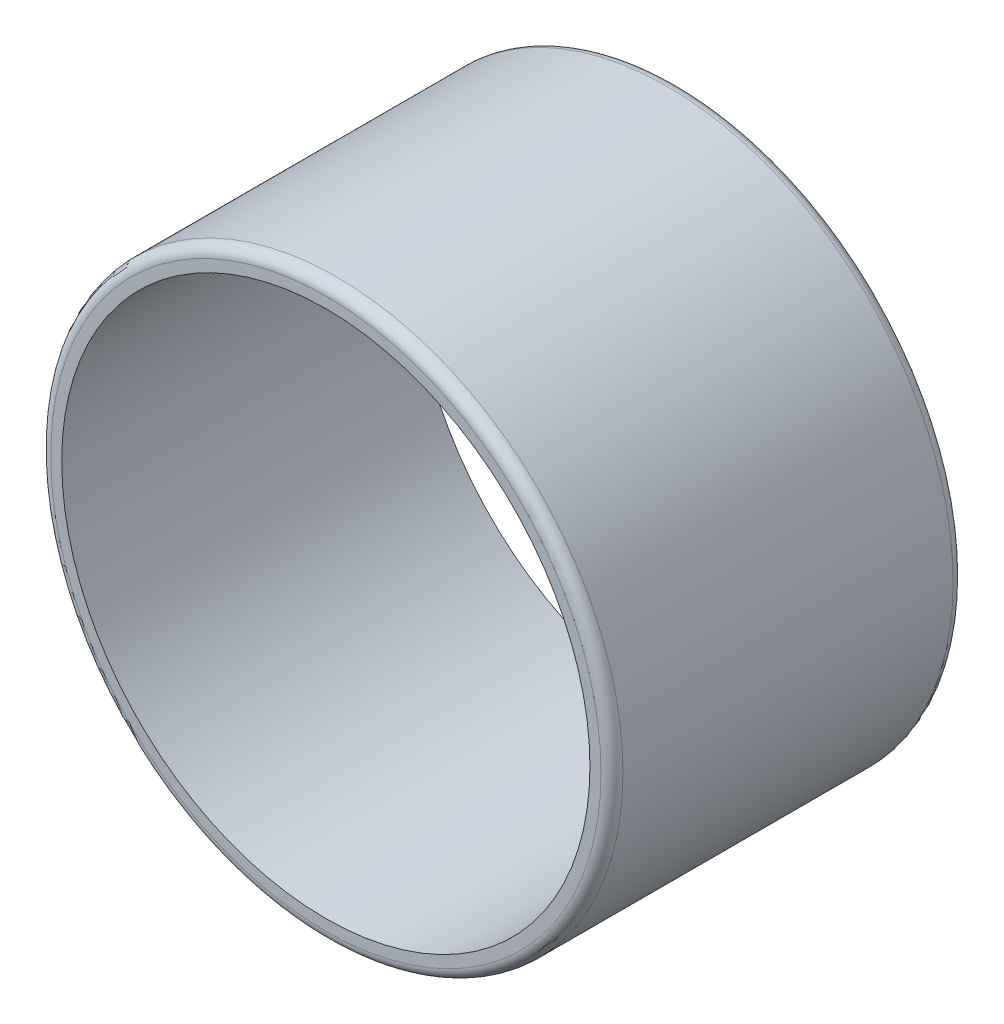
from build123d import *

# Parameters (mm, degrees)
ESQUISSE1_R      = 13
ESQUISSE1_R_2    = 12
EXTRUSION1_DEPTH = 8
CONG_1_R         = 0.5


with BuildPart() as part:
    # Esquisse1 → Extrusion1 (new, symmetric)
    with BuildSketch(Plane.XY):
        Circle(ESQUISSE1_R)
        Circle(ESQUISSE1_R_2, mode=Mode.SUBTRACT)
    extrude(amount=EXTRUSION1_DEPTH, both=True)

    # Cong_1
    cong_1_edges = [part.edges().sort_by_distance(p)[0] for p in [
        (-13, 0, -8),
        (-13, 0, 8),
    ]]
    fillet(cong_1_edges, radius=CONG_1_R)


solid = part.part
